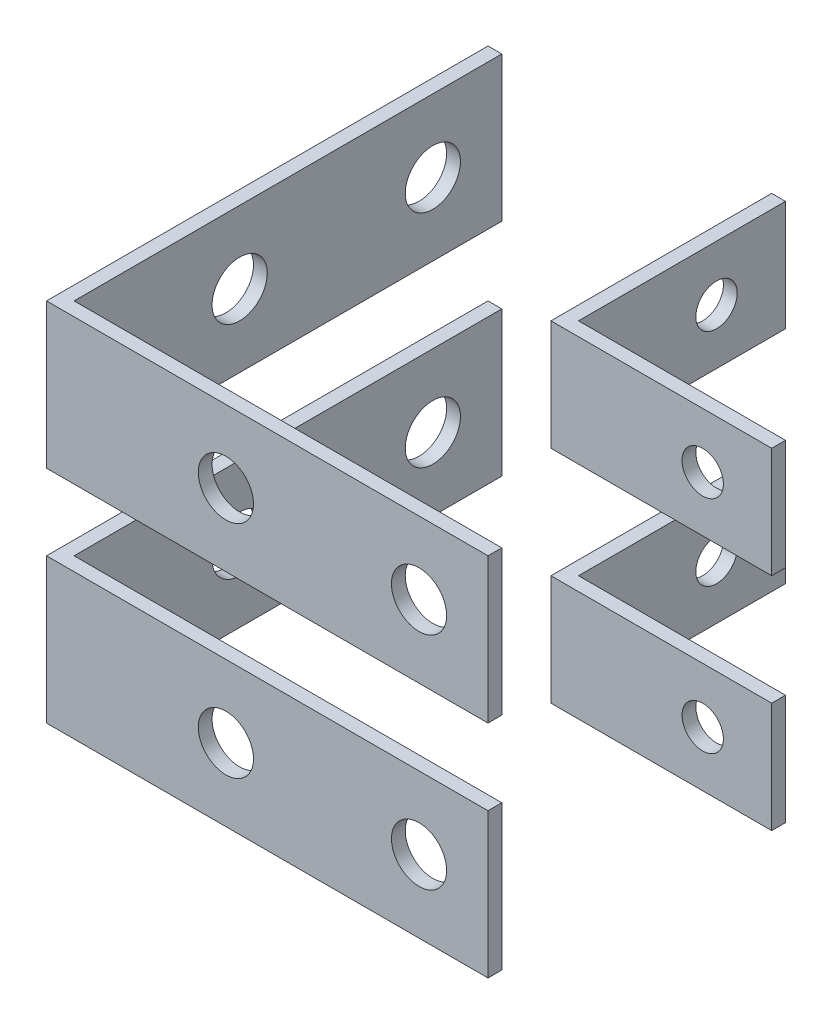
from build123d import *

# Parameters (mm, degrees)
EXTRUDE_THIN1_START = 4.365625
EXTRUDE_THIN1_DEPTH = 16.66875
EXTRUDE_THIN2_START = -4.365625
EXTRUDE_THIN2_DEPTH = 16.66875
EXTRUDE_THIN3_START = 6.35
EXTRUDE_THIN3_DEPTH = 12.7
EXTRUDE_THIN4_START = -6.35
EXTRUDE_THIN4_DEPTH = 12.7
SKETCH3_R           = 3.175
CUT_EXTRUDE1_DEPTH  = 1.5875
SKETCH4_R           = 3.175
CUT_EXTRUDE2_DEPTH  = 1.5875
SKETCH5_R           = 2.38125
CUT_EXTRUDE3_DEPTH  = 1.5875
SKETCH6_R           = 2.38125
CUT_EXTRUDE4_DEPTH  = 1.5875


with BuildPart() as part:
    # Sketch1 → Extrude-Thin1 (new body)
    with BuildSketch(Plane(origin=(0, 0, 0), x_dir=(1, 0, 0), z_dir=(0, 1, 0)).offset(EXTRUDE_THIN1_START)):
        Polygon((49.2125, 0), (0, 0), (0, 49.2125), (-1.5875, 49.2125), (-1.5875, -1.5875), (49.2125, -1.5875), align=None)
    extrude(amount=EXTRUDE_THIN1_DEPTH)


with BuildPart() as body_2:
    # Sketch1_2 → Extrude-Thin2 (new body)
    with BuildSketch(Plane(origin=(0, 0, 0), x_dir=(1, 0, 0), z_dir=(0, 1, 0)).offset(EXTRUDE_THIN2_START)):
        Polygon((49.2125, 0), (0, 0), (0, 49.2125), (-1.5875, 49.2125), (-1.5875, -1.5875), (49.2125, -1.5875), align=None)
    extrude(amount=-EXTRUDE_THIN2_DEPTH)


with BuildPart() as body_3:
    # Sketch2 → Extrude-Thin3 (new body)
    with BuildSketch(Plane(origin=(0, 0, 0), x_dir=(1, 0, 0), z_dir=(0, 1, 0)).offset(EXTRUDE_THIN3_START)):
        Polygon((52.832, 27.432), (27.432, 27.432), (27.432, 52.832), (29.0195, 52.832), (29.0195, 29.0195), (52.832, 29.0195), align=None)
    extrude(amount=EXTRUDE_THIN3_DEPTH)


with BuildPart() as body_4:
    # Sketch2_2 → Extrude-Thin4 (new body)
    with BuildSketch(Plane(origin=(0, 0, 0), x_dir=(1, 0, 0), z_dir=(0, 1, 0)).offset(EXTRUDE_THIN4_START)):
        Polygon((52.832, 27.432), (27.432, 27.432), (27.432, 52.832), (29.0195, 52.832), (29.0195, 29.0195), (52.832, 29.0195), align=None)
    extrude(amount=-EXTRUDE_THIN4_DEPTH)


with BuildPart() as cut_extrude1_tool:
    # Sketch3 → Cut-Extrude1 (new body)
    with BuildSketch(Plane.XY):
        with Locations(Location((19.05, 12.7, 0), (0, 0, 180))):
            Circle(SKETCH3_R)
        with Locations(Location((41.275, 12.7, 0), (0, 0, 180))):
            Circle(SKETCH3_R)
        with Locations((41.275, -12.7)):
            Circle(SKETCH3_R)
        with Locations((19.05, -12.7)):
            Circle(SKETCH3_R)
    extrude(amount=CUT_EXTRUDE1_DEPTH)


with BuildPart() as part_1:
    add(part.part)

    # Cut-Extrude1: cut by cut_extrude1_tool
    add(cut_extrude1_tool.part, mode=Mode.SUBTRACT)


with BuildPart() as body_2_1:
    add(body_2.part)

    # Cut-Extrude1: cut by cut_extrude1_tool
    add(cut_extrude1_tool.part, mode=Mode.SUBTRACT)


with BuildPart() as cut_extrude2_tool:
    # Sketch4 → Cut-Extrude2 (new body)
    with BuildSketch(Plane(origin=(0, 0, 0), x_dir=(0, 0, -1), z_dir=(1, 0, 0))):
        with Locations((41.275, 12.7)):
            Circle(SKETCH4_R)
        with Locations((19.05, 12.7)):
            Circle(SKETCH4_R)
        with Locations((19.05, -12.7)):
            Circle(SKETCH4_R)
        with Locations((41.275, -12.7)):
            Circle(SKETCH4_R)
    extrude(amount=-CUT_EXTRUDE2_DEPTH)


with BuildPart() as part_2:
    add(part_1.part)

    # Cut-Extrude2: cut by cut_extrude2_tool
    add(cut_extrude2_tool.part, mode=Mode.SUBTRACT)


with BuildPart() as body_2_2:
    add(body_2_1.part)

    # Cut-Extrude2: cut by cut_extrude2_tool
    add(cut_extrude2_tool.part, mode=Mode.SUBTRACT)


with BuildPart() as cut_extrude3_tool:
    # Sketch5 → Cut-Extrude3 (new body)
    with BuildSketch(Plane(origin=(0, 0, -29.0195), x_dir=(-1, 0, 0), z_dir=(0, 0, -1))):
        with Locations((-44.8945, 12.7)):
            Circle(SKETCH5_R)
        with Locations((-44.8945, -12.7)):
            Circle(SKETCH5_R)
    extrude(amount=-CUT_EXTRUDE3_DEPTH)


with BuildPart() as body_3_1:
    add(body_3.part)

    # Cut-Extrude3: cut by cut_extrude3_tool
    add(cut_extrude3_tool.part, mode=Mode.SUBTRACT)


with BuildPart() as body_4_1:
    add(body_4.part)

    # Cut-Extrude3: cut by cut_extrude3_tool
    add(cut_extrude3_tool.part, mode=Mode.SUBTRACT)


with BuildPart() as cut_extrude4_tool:
    # Sketch6 → Cut-Extrude4 (new body)
    with BuildSketch(Plane(origin=(29.0195, 0, 0), x_dir=(0, 0, -1), z_dir=(1, 0, 0))):
        with Locations((44.8945, 12.7)):
            Circle(SKETCH6_R)
        with Locations((44.8945, -12.7)):
            Circle(SKETCH6_R)
    extrude(amount=-CUT_EXTRUDE4_DEPTH)


with BuildPart() as body_3_2:
    add(body_3_1.part)

    # Cut-Extrude4: cut by cut_extrude4_tool
    add(cut_extrude4_tool.part, mode=Mode.SUBTRACT)


with BuildPart() as body_4_2:
    add(body_4_1.part)

    # Cut-Extrude4: cut by cut_extrude4_tool
    add(cut_extrude4_tool.part, mode=Mode.SUBTRACT)


solid = Compound([part_2.part, body_2_2.part, body_3_2.part, body_4_2.part])
